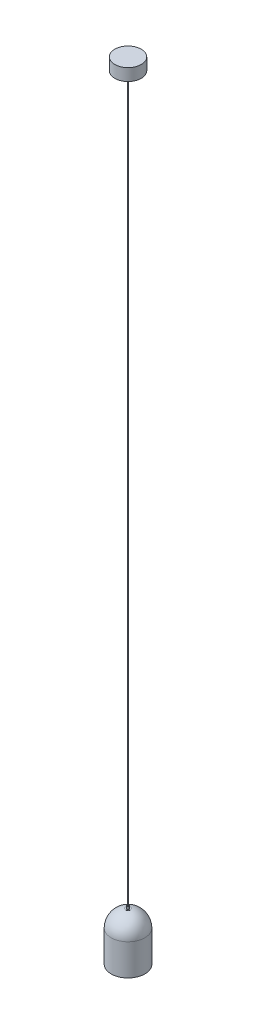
ISO-10303-21;
HEADER;
FILE_DESCRIPTION(('STEP AP214'),'2;1');
FILE_NAME('part.step','',(''),(''),'','','');
FILE_SCHEMA(('AUTOMOTIVE_DESIGN { 1 0 10303 214 1 1 1 1 }'));
ENDSEC;
DATA;
#1=APPLICATION_CONTEXT('core data for automotive mechanical design processes');
#2=APPLICATION_PROTOCOL_DEFINITION('international standard','automotive_design',2000,#1);
#3=PRODUCT_CONTEXT('',#1,'mechanical');
#4=PRODUCT('Part','Part','',(#3));
#5=PRODUCT_RELATED_PRODUCT_CATEGORY('part','',(#4));
#6=PRODUCT_DEFINITION_FORMATION('','',#4);
#7=PRODUCT_DEFINITION_CONTEXT('part definition',#1,'design');
#8=PRODUCT_DEFINITION('design','',#6,#7);
#9=PRODUCT_DEFINITION_SHAPE('','',#8);
#10=(LENGTH_UNIT() NAMED_UNIT(*) SI_UNIT(.MILLI.,.METRE.));
#11=(NAMED_UNIT(*) PLANE_ANGLE_UNIT() SI_UNIT($,.RADIAN.));
#12=(NAMED_UNIT(*) SI_UNIT($,.STERADIAN.) SOLID_ANGLE_UNIT());
#13=UNCERTAINTY_MEASURE_WITH_UNIT(LENGTH_MEASURE(1.E-05),#10,'distance_accuracy_value','');
#14=(GEOMETRIC_REPRESENTATION_CONTEXT(3) GLOBAL_UNCERTAINTY_ASSIGNED_CONTEXT((#13)) GLOBAL_UNIT_ASSIGNED_CONTEXT((#10,
#11,#12)) REPRESENTATION_CONTEXT('',''));
#15=CARTESIAN_POINT('',(0.,0.,0.));
#16=DIRECTION('',(0.,0.,1.));
#17=DIRECTION('',(1.,0.,0.));
#18=AXIS2_PLACEMENT_3D('',#15,#16,#17);
#19=CARTESIAN_POINT('',(0.,3210.,0.));
#20=DIRECTION('',(0.,-1.,0.));
#21=DIRECTION('',(0.,0.,-1.));
#22=AXIS2_PLACEMENT_3D('',#19,#20,#21);
#23=CYLINDRICAL_SURFACE('',#22,1.5);
#24=CARTESIAN_POINT('',(0.,3210.,0.));
#25=DIRECTION('',(0.,1.,0.));
#26=DIRECTION('',(0.,0.,1.));
#27=AXIS2_PLACEMENT_3D('',#24,#25,#26);
#28=CIRCLE('',#27,1.5);
#29=CARTESIAN_POINT('',(0.,3210.,1.5));
#30=VERTEX_POINT('',#29);
#31=EDGE_CURVE('E11',#30,#30,#28,.T.);
#32=ORIENTED_EDGE('',*,*,#31,.F.);
#33=EDGE_LOOP('',(#32));
#34=FACE_BOUND('',#33,.T.);
#35=CARTESIAN_POINT('',(0.,210.,0.));
#36=DIRECTION('',(0.,1.,0.));
#37=DIRECTION('',(0.,0.,1.));
#38=AXIS2_PLACEMENT_3D('',#35,#36,#37);
#39=CIRCLE('',#38,1.5);
#40=CARTESIAN_POINT('',(0.,210.,1.5));
#41=VERTEX_POINT('',#40);
#42=EDGE_CURVE('E53',#41,#41,#39,.T.);
#43=ORIENTED_EDGE('',*,*,#42,.T.);
#44=EDGE_LOOP('',(#43));
#45=FACE_BOUND('',#44,.T.);
#46=ADVANCED_FACE('F50',(#34,#45),#23,.T.);
#47=CARTESIAN_POINT('',(0.,210.,0.));
#48=DIRECTION('',(0.,1.,0.));
#49=DIRECTION('',(0.,0.,1.));
#50=AXIS2_PLACEMENT_3D('',#47,#48,#49);
#51=PLANE('',#50);
#52=ORIENTED_EDGE('',*,*,#42,.F.);
#53=EDGE_LOOP('',(#52));
#54=FACE_BOUND('',#53,.T.);
#55=ADVANCED_FACE('F73',(#54),#51,.F.);
#56=CARTESIAN_POINT('',(0.,3260.038,0.));
#57=DIRECTION('',(0.,-1.,0.));
#58=DIRECTION('',(0.,0.,-1.));
#59=AXIS2_PLACEMENT_3D('',#56,#57,#58);
#60=CYLINDRICAL_SURFACE('',#59,54.991);
#61=CARTESIAN_POINT('',(0.,3260.038,0.));
#62=DIRECTION('',(0.,1.,0.));
#63=DIRECTION('',(0.,0.,1.));
#64=AXIS2_PLACEMENT_3D('',#61,#62,#63);
#65=CIRCLE('',#64,54.991);
#66=CARTESIAN_POINT('',(0.,3260.038,54.991));
#67=VERTEX_POINT('',#66);
#68=EDGE_CURVE('E60',#67,#67,#65,.T.);
#69=ORIENTED_EDGE('',*,*,#68,.F.);
#70=EDGE_LOOP('',(#69));
#71=FACE_BOUND('',#70,.T.);
#72=CARTESIAN_POINT('',(0.,3210.,0.));
#73=DIRECTION('',(0.,1.,0.));
#74=DIRECTION('',(0.,0.,1.));
#75=AXIS2_PLACEMENT_3D('',#72,#73,#74);
#76=CIRCLE('',#75,54.991);
#77=CARTESIAN_POINT('',(0.,3210.,54.991));
#78=VERTEX_POINT('',#77);
#79=EDGE_CURVE('E62',#78,#78,#76,.T.);
#80=ORIENTED_EDGE('',*,*,#79,.T.);
#81=EDGE_LOOP('',(#80));
#82=FACE_BOUND('',#81,.T.);
#83=ADVANCED_FACE('F70',(#71,#82),#60,.T.);
#84=CARTESIAN_POINT('',(0.,3260.038,0.));
#85=DIRECTION('',(0.,1.,0.));
#86=DIRECTION('',(0.,0.,1.));
#87=AXIS2_PLACEMENT_3D('',#84,#85,#86);
#88=PLANE('',#87);
#89=ORIENTED_EDGE('',*,*,#68,.T.);
#90=EDGE_LOOP('',(#89));
#91=FACE_BOUND('',#90,.T.);
#92=ADVANCED_FACE('F68',(#91),#88,.T.);
#93=CARTESIAN_POINT('',(0.,3210.,0.));
#94=DIRECTION('',(0.,1.,0.));
#95=DIRECTION('',(0.,0.,1.));
#96=AXIS2_PLACEMENT_3D('',#93,#94,#95);
#97=PLANE('',#96);
#98=ORIENTED_EDGE('',*,*,#31,.T.);
#99=EDGE_LOOP('',(#98));
#100=FACE_BOUND('',#99,.T.);
#101=ORIENTED_EDGE('',*,*,#79,.F.);
#102=EDGE_LOOP('',(#101));
#103=FACE_BOUND('',#102,.T.);
#104=ADVANCED_FACE('F77',(#100,#103),#97,.F.);
#105=CLOSED_SHELL('',(#46,#55,#83,#92,#104));
#106=MANIFOLD_SOLID_BREP('B2',#105);
#107=CARTESIAN_POINT('',(0.,201.,0.));
#108=DIRECTION('',(0.,-1.,0.));
#109=DIRECTION('',(0.,0.,-1.));
#110=AXIS2_PLACEMENT_3D('',#107,#108,#109);
#111=CYLINDRICAL_SURFACE('',#110,10.);
#112=CARTESIAN_POINT('',(0.,201.,0.));
#113=DIRECTION('',(0.,1.,0.));
#114=DIRECTION('',(0.,0.,1.));
#115=AXIS2_PLACEMENT_3D('',#112,#113,#114);
#116=CIRCLE('',#115,10.);
#117=CARTESIAN_POINT('',(0.,201.,10.));
#118=VERTEX_POINT('',#117);
#119=EDGE_CURVE('E49',#118,#118,#116,.T.);
#120=ORIENTED_EDGE('',*,*,#119,.F.);
#121=EDGE_LOOP('',(#120));
#122=FACE_BOUND('',#121,.T.);
#123=CARTESIAN_POINT('',(0.,200.,0.));
#124=DIRECTION('',(0.,1.,0.));
#125=DIRECTION('',(0.,0.,1.));
#126=AXIS2_PLACEMENT_3D('',#123,#124,#125);
#127=CIRCLE('',#126,10.);
#128=CARTESIAN_POINT('',(0.,200.,10.));
#129=VERTEX_POINT('',#128);
#130=EDGE_CURVE('E142',#129,#129,#127,.T.);
#131=ORIENTED_EDGE('',*,*,#130,.T.);
#132=EDGE_LOOP('',(#131));
#133=FACE_BOUND('',#132,.T.);
#134=ADVANCED_FACE('F139',(#122,#133),#111,.T.);
#135=CARTESIAN_POINT('',(0.,201.,0.));
#136=DIRECTION('',(0.,1.,0.));
#137=DIRECTION('',(0.,0.,1.));
#138=AXIS2_PLACEMENT_3D('',#135,#136,#137);
#139=PLANE('',#138);
#140=ORIENTED_EDGE('',*,*,#119,.T.);
#141=EDGE_LOOP('',(#140));
#142=FACE_BOUND('',#141,.T.);
#143=ADVANCED_FACE('F154',(#142),#139,.T.);
#144=CARTESIAN_POINT('',(0.,200.,0.));
#145=DIRECTION('',(0.,1.,0.));
#146=DIRECTION('',(0.,0.,1.));
#147=AXIS2_PLACEMENT_3D('',#144,#145,#146);
#148=PLANE('',#147);
#149=ORIENTED_EDGE('',*,*,#130,.F.);
#150=EDGE_LOOP('',(#149));
#151=FACE_BOUND('',#150,.T.);
#152=ADVANCED_FACE('F152',(#151),#148,.F.);
#153=CLOSED_SHELL('',(#134,#143,#152));
#154=MANIFOLD_SOLID_BREP('B6',#153);
#155=CARTESIAN_POINT('',(0.,210.,0.));
#156=DIRECTION('',(0.,-1.,0.));
#157=DIRECTION('',(0.,0.,-1.));
#158=AXIS2_PLACEMENT_3D('',#155,#156,#157);
#159=CYLINDRICAL_SURFACE('',#158,5.);
#160=CARTESIAN_POINT('',(0.,210.,0.));
#161=DIRECTION('',(0.,1.,0.));
#162=DIRECTION('',(0.,0.,1.));
#163=AXIS2_PLACEMENT_3D('',#160,#161,#162);
#164=CIRCLE('',#163,5.);
#165=CARTESIAN_POINT('',(0.,210.,5.));
#166=VERTEX_POINT('',#165);
#167=EDGE_CURVE('E138',#166,#166,#164,.T.);
#168=ORIENTED_EDGE('',*,*,#167,.F.);
#169=EDGE_LOOP('',(#168));
#170=FACE_BOUND('',#169,.T.);
#171=CARTESIAN_POINT('',(0.,200.,0.));
#172=DIRECTION('',(0.,1.,0.));
#173=DIRECTION('',(0.,0.,1.));
#174=AXIS2_PLACEMENT_3D('',#171,#172,#173);
#175=CIRCLE('',#174,5.);
#176=CARTESIAN_POINT('',(0.,200.,5.));
#177=VERTEX_POINT('',#176);
#178=EDGE_CURVE('E196',#177,#177,#175,.T.);
#179=ORIENTED_EDGE('',*,*,#178,.T.);
#180=EDGE_LOOP('',(#179));
#181=FACE_BOUND('',#180,.T.);
#182=ADVANCED_FACE('F193',(#170,#181),#159,.T.);
#183=CARTESIAN_POINT('',(0.,210.,0.));
#184=DIRECTION('',(0.,1.,0.));
#185=DIRECTION('',(0.,0.,1.));
#186=AXIS2_PLACEMENT_3D('',#183,#184,#185);
#187=PLANE('',#186);
#188=ORIENTED_EDGE('',*,*,#167,.T.);
#189=EDGE_LOOP('',(#188));
#190=FACE_BOUND('',#189,.T.);
#191=ADVANCED_FACE('F208',(#190),#187,.T.);
#192=CARTESIAN_POINT('',(0.,200.,0.));
#193=DIRECTION('',(0.,1.,0.));
#194=DIRECTION('',(0.,0.,1.));
#195=AXIS2_PLACEMENT_3D('',#192,#193,#194);
#196=PLANE('',#195);
#197=ORIENTED_EDGE('',*,*,#178,.F.);
#198=EDGE_LOOP('',(#197));
#199=FACE_BOUND('',#198,.T.);
#200=ADVANCED_FACE('F206',(#199),#196,.F.);
#201=CLOSED_SHELL('',(#182,#191,#200));
#202=MANIFOLD_SOLID_BREP('B44',#201);
#203=CARTESIAN_POINT('',(0.,130.,0.));
#204=DIRECTION('',(0.,-1.,0.));
#205=DIRECTION('',(1.,0.,0.));
#206=AXIS2_PLACEMENT_3D('',#203,#204,#205);
#207=SPHERICAL_SURFACE('',#206,70.);
#208=CARTESIAN_POINT('',(0.,130.,0.));
#209=DIRECTION('',(0.,-1.,0.));
#210=DIRECTION('',(1.,0.,0.));
#211=AXIS2_PLACEMENT_3D('',#208,#209,#210);
#212=CIRCLE('',#211,70.);
#213=CARTESIAN_POINT('',(70.,130.,0.));
#214=VERTEX_POINT('',#213);
#215=EDGE_CURVE('E192',#214,#214,#212,.T.);
#216=ORIENTED_EDGE('',*,*,#215,.F.);
#217=EDGE_LOOP('',(#216));
#218=FACE_BOUND('',#217,.T.);
#219=ADVANCED_FACE('F240',(#218),#207,.T.);
#220=CARTESIAN_POINT('',(0.,0.,0.));
#221=DIRECTION('',(0.,-1.,0.));
#222=DIRECTION('',(1.,0.,0.));
#223=AXIS2_PLACEMENT_3D('',#220,#221,#222);
#224=CYLINDRICAL_SURFACE('',#223,70.);
#225=ORIENTED_EDGE('',*,*,#215,.T.);
#226=EDGE_LOOP('',(#225));
#227=FACE_BOUND('',#226,.T.);
#228=CARTESIAN_POINT('',(0.,0.,0.));
#229=DIRECTION('',(0.,-1.,0.));
#230=DIRECTION('',(1.,0.,0.));
#231=AXIS2_PLACEMENT_3D('',#228,#229,#230);
#232=CIRCLE('',#231,70.);
#233=CARTESIAN_POINT('',(70.,0.,0.));
#234=VERTEX_POINT('',#233);
#235=EDGE_CURVE('E246',#234,#234,#232,.T.);
#236=ORIENTED_EDGE('',*,*,#235,.F.);
#237=EDGE_LOOP('',(#236));
#238=FACE_BOUND('',#237,.T.);
#239=ADVANCED_FACE('F265',(#227,#238),#224,.T.);
#240=CARTESIAN_POINT('',(0.,0.,0.));
#241=DIRECTION('',(0.,-1.,0.));
#242=DIRECTION('',(1.,0.,0.));
#243=AXIS2_PLACEMENT_3D('',#240,#241,#242);
#244=PLANE('',#243);
#245=CARTESIAN_POINT('',(0.,0.,0.));
#246=DIRECTION('',(0.,-1.,0.));
#247=DIRECTION('',(1.,0.,0.));
#248=AXIS2_PLACEMENT_3D('',#245,#246,#247);
#249=CIRCLE('',#248,67.);
#250=CARTESIAN_POINT('',(67.,0.,0.));
#251=VERTEX_POINT('',#250);
#252=EDGE_CURVE('E254',#251,#251,#249,.T.);
#253=ORIENTED_EDGE('',*,*,#252,.F.);
#254=EDGE_LOOP('',(#253));
#255=FACE_BOUND('',#254,.T.);
#256=ORIENTED_EDGE('',*,*,#235,.T.);
#257=EDGE_LOOP('',(#256));
#258=FACE_BOUND('',#257,.T.);
#259=ADVANCED_FACE('F262',(#255,#258),#244,.T.);
#260=CARTESIAN_POINT('',(0.,130.,0.));
#261=DIRECTION('',(0.,-1.,0.));
#262=DIRECTION('',(1.,0.,0.));
#263=AXIS2_PLACEMENT_3D('',#260,#261,#262);
#264=SPHERICAL_SURFACE('',#263,67.);
#265=CARTESIAN_POINT('',(0.,130.,0.));
#266=DIRECTION('',(0.,-1.,0.));
#267=DIRECTION('',(1.,0.,0.));
#268=AXIS2_PLACEMENT_3D('',#265,#266,#267);
#269=CIRCLE('',#268,67.);
#270=CARTESIAN_POINT('',(67.,130.,0.));
#271=VERTEX_POINT('',#270);
#272=EDGE_CURVE('E250',#271,#271,#269,.T.);
#273=ORIENTED_EDGE('',*,*,#272,.T.);
#274=EDGE_LOOP('',(#273));
#275=FACE_BOUND('',#274,.T.);
#276=ADVANCED_FACE('F264',(#275),#264,.F.);
#277=CARTESIAN_POINT('',(0.,0.,0.));
#278=DIRECTION('',(0.,-1.,0.));
#279=DIRECTION('',(1.,0.,0.));
#280=AXIS2_PLACEMENT_3D('',#277,#278,#279);
#281=CYLINDRICAL_SURFACE('',#280,67.);
#282=ORIENTED_EDGE('',*,*,#272,.F.);
#283=EDGE_LOOP('',(#282));
#284=FACE_BOUND('',#283,.T.);
#285=ORIENTED_EDGE('',*,*,#252,.T.);
#286=EDGE_LOOP('',(#285));
#287=FACE_BOUND('',#286,.T.);
#288=ADVANCED_FACE('F260',(#284,#287),#281,.F.);
#289=CLOSED_SHELL('',(#219,#239,#259,#276,#288));
#290=MANIFOLD_SOLID_BREP('B133',#289);
#291=ADVANCED_BREP_SHAPE_REPRESENTATION('',(#18,#106,#154,#202,#290),#14);
#292=SHAPE_DEFINITION_REPRESENTATION(#9,#291);
ENDSEC;
END-ISO-10303-21;
